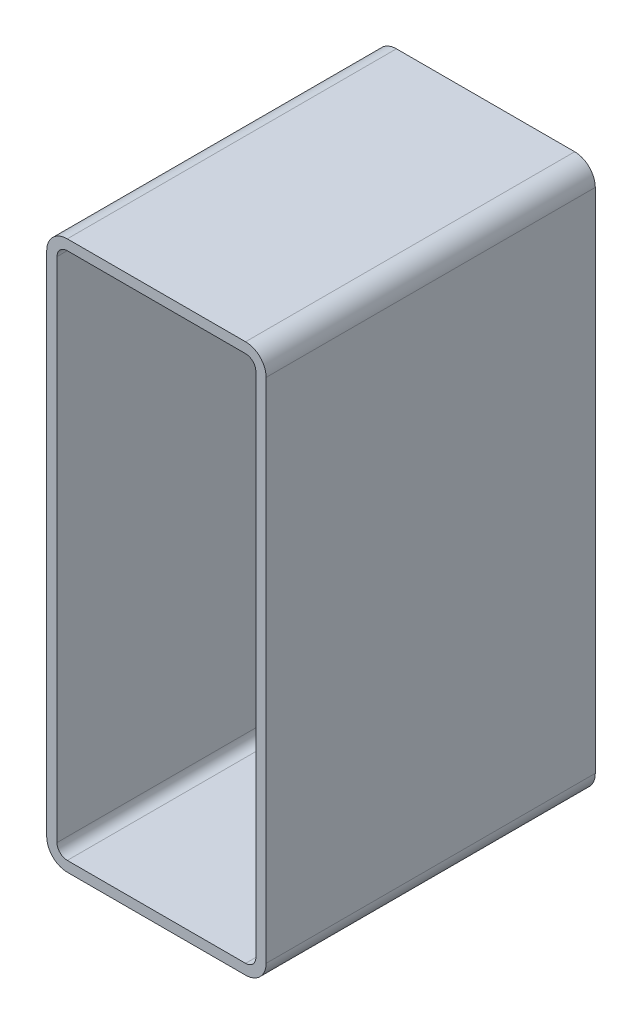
ISO-10303-21;
HEADER;
FILE_DESCRIPTION(('STEP AP214'),'2;1');
FILE_NAME('part.step','',(''),(''),'','','');
FILE_SCHEMA(('AUTOMOTIVE_DESIGN { 1 0 10303 214 1 1 1 1 }'));
ENDSEC;
DATA;
#1=APPLICATION_CONTEXT('core data for automotive mechanical design processes');
#2=APPLICATION_PROTOCOL_DEFINITION('international standard','automotive_design',2000,#1);
#3=PRODUCT_CONTEXT('',#1,'mechanical');
#4=PRODUCT('Part','Part','',(#3));
#5=PRODUCT_RELATED_PRODUCT_CATEGORY('part','',(#4));
#6=PRODUCT_DEFINITION_FORMATION('','',#4);
#7=PRODUCT_DEFINITION_CONTEXT('part definition',#1,'design');
#8=PRODUCT_DEFINITION('design','',#6,#7);
#9=PRODUCT_DEFINITION_SHAPE('','',#8);
#10=(LENGTH_UNIT() NAMED_UNIT(*) SI_UNIT(.MILLI.,.METRE.));
#11=(NAMED_UNIT(*) PLANE_ANGLE_UNIT() SI_UNIT($,.RADIAN.));
#12=(NAMED_UNIT(*) SI_UNIT($,.STERADIAN.) SOLID_ANGLE_UNIT());
#13=UNCERTAINTY_MEASURE_WITH_UNIT(LENGTH_MEASURE(1.E-05),#10,'distance_accuracy_value','');
#14=(GEOMETRIC_REPRESENTATION_CONTEXT(3) GLOBAL_UNCERTAINTY_ASSIGNED_CONTEXT((#13)) GLOBAL_UNIT_ASSIGNED_CONTEXT((#10,
#11,#12)) REPRESENTATION_CONTEXT('',''));
#15=CARTESIAN_POINT('',(0.,0.,0.));
#16=DIRECTION('',(0.,0.,1.));
#17=DIRECTION('',(1.,0.,0.));
#18=AXIS2_PLACEMENT_3D('',#15,#16,#17);
#19=CARTESIAN_POINT('',(20.4409404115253,20.741228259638,304.8));
#20=DIRECTION('',(0.,0.,1.));
#21=DIRECTION('',(1.,0.,0.));
#22=AXIS2_PLACEMENT_3D('',#19,#20,#21);
#23=PLANE('',#22);
#24=CARTESIAN_POINT('',(20.4409404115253,20.741228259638,304.8));
#25=DIRECTION('',(0.,0.,1.));
#26=DIRECTION('',(1.,0.,0.));
#27=AXIS2_PLACEMENT_3D('',#24,#25,#26);
#28=CIRCLE('',#27,19.05);
#29=CARTESIAN_POINT('',(1.3909404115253,20.741228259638,304.8));
#30=VERTEX_POINT('',#29);
#31=CARTESIAN_POINT('',(20.4409404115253,1.69122825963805,304.8));
#32=VERTEX_POINT('',#31);
#33=EDGE_CURVE('E211',#30,#32,#28,.T.);
#34=ORIENTED_EDGE('',*,*,#33,.T.);
#35=DIRECTION('',(1.,0.,0.));
#36=VECTOR('',#35,1.);
#37=CARTESIAN_POINT('',(185.540940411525,1.691228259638,304.8));
#38=LINE('',#37,#36);
#39=CARTESIAN_POINT('',(185.540940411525,1.69122825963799,304.8));
#40=VERTEX_POINT('',#39);
#41=EDGE_CURVE('E214',#32,#40,#38,.T.);
#42=ORIENTED_EDGE('',*,*,#41,.T.);
#43=CARTESIAN_POINT('',(185.540940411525,20.741228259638,304.8));
#44=DIRECTION('',(0.,0.,1.));
#45=DIRECTION('',(1.,0.,0.));
#46=AXIS2_PLACEMENT_3D('',#43,#44,#45);
#47=CIRCLE('',#46,19.05);
#48=CARTESIAN_POINT('',(204.590940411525,20.741228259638,304.8));
#49=VERTEX_POINT('',#48);
#50=EDGE_CURVE('E217',#40,#49,#47,.T.);
#51=ORIENTED_EDGE('',*,*,#50,.T.);
#52=DIRECTION('',(0.,1.,0.));
#53=VECTOR('',#52,1.);
#54=CARTESIAN_POINT('',(204.590940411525,490.641228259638,304.8));
#55=LINE('',#54,#53);
#56=CARTESIAN_POINT('',(204.590940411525,490.641228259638,304.8));
#57=VERTEX_POINT('',#56);
#58=EDGE_CURVE('E219',#49,#57,#55,.T.);
#59=ORIENTED_EDGE('',*,*,#58,.T.);
#60=CARTESIAN_POINT('',(185.540940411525,490.641228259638,304.8));
#61=DIRECTION('',(0.,0.,1.));
#62=DIRECTION('',(1.,0.,0.));
#63=AXIS2_PLACEMENT_3D('',#60,#61,#62);
#64=CIRCLE('',#63,19.0499999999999);
#65=CARTESIAN_POINT('',(185.540940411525,509.691228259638,304.8));
#66=VERTEX_POINT('',#65);
#67=EDGE_CURVE('E221',#57,#66,#64,.T.);
#68=ORIENTED_EDGE('',*,*,#67,.T.);
#69=DIRECTION('',(-1.,0.,0.));
#70=VECTOR('',#69,1.);
#71=CARTESIAN_POINT('',(20.4409404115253,509.691228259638,304.8));
#72=LINE('',#71,#70);
#73=CARTESIAN_POINT('',(20.4409404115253,509.691228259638,304.8));
#74=VERTEX_POINT('',#73);
#75=EDGE_CURVE('E223',#66,#74,#72,.T.);
#76=ORIENTED_EDGE('',*,*,#75,.T.);
#77=CARTESIAN_POINT('',(20.4409404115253,490.641228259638,304.8));
#78=DIRECTION('',(0.,0.,1.));
#79=DIRECTION('',(1.,0.,0.));
#80=AXIS2_PLACEMENT_3D('',#77,#78,#79);
#81=CIRCLE('',#80,19.0499999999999);
#82=CARTESIAN_POINT('',(1.3909404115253,490.641228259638,304.8));
#83=VERTEX_POINT('',#82);
#84=EDGE_CURVE('E225',#74,#83,#81,.T.);
#85=ORIENTED_EDGE('',*,*,#84,.T.);
#86=DIRECTION('',(0.,-1.,0.));
#87=VECTOR('',#86,1.);
#88=CARTESIAN_POINT('',(1.3909404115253,20.741228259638,304.8));
#89=LINE('',#88,#87);
#90=EDGE_CURVE('E227',#83,#30,#89,.T.);
#91=ORIENTED_EDGE('',*,*,#90,.T.);
#92=EDGE_LOOP('',(#34,#42,#51,#59,#68,#76,#85,#91));
#93=FACE_BOUND('',#92,.T.);
#94=DIRECTION('',(0.,-1.,0.));
#95=VECTOR('',#94,1.);
#96=CARTESIAN_POINT('',(10.9159404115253,20.741228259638,304.8));
#97=LINE('',#96,#95);
#98=CARTESIAN_POINT('',(10.9159404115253,490.641228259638,304.8));
#99=VERTEX_POINT('',#98);
#100=CARTESIAN_POINT('',(10.9159404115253,20.741228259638,304.8));
#101=VERTEX_POINT('',#100);
#102=EDGE_CURVE('E154',#99,#101,#97,.T.);
#103=ORIENTED_EDGE('',*,*,#102,.F.);
#104=CARTESIAN_POINT('',(20.4409404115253,490.641228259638,304.8));
#105=DIRECTION('',(0.,0.,1.));
#106=DIRECTION('',(1.,0.,0.));
#107=AXIS2_PLACEMENT_3D('',#104,#105,#106);
#108=CIRCLE('',#107,9.52499999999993);
#109=CARTESIAN_POINT('',(20.4409404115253,500.166228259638,304.8));
#110=VERTEX_POINT('',#109);
#111=EDGE_CURVE('E146',#110,#99,#108,.T.);
#112=ORIENTED_EDGE('',*,*,#111,.F.);
#113=DIRECTION('',(-1.,0.,0.));
#114=VECTOR('',#113,1.);
#115=CARTESIAN_POINT('',(20.4409404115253,500.166228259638,304.8));
#116=LINE('',#115,#114);
#117=CARTESIAN_POINT('',(185.540940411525,500.166228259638,304.8));
#118=VERTEX_POINT('',#117);
#119=EDGE_CURVE('E179',#118,#110,#116,.T.);
#120=ORIENTED_EDGE('',*,*,#119,.F.);
#121=CARTESIAN_POINT('',(185.540940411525,490.641228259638,304.8));
#122=DIRECTION('',(0.,0.,1.));
#123=DIRECTION('',(1.,0.,0.));
#124=AXIS2_PLACEMENT_3D('',#121,#122,#123);
#125=CIRCLE('',#124,9.52499999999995);
#126=CARTESIAN_POINT('',(195.065940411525,490.641228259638,304.8));
#127=VERTEX_POINT('',#126);
#128=EDGE_CURVE('E177',#127,#118,#125,.T.);
#129=ORIENTED_EDGE('',*,*,#128,.F.);
#130=DIRECTION('',(0.,1.,0.));
#131=VECTOR('',#130,1.);
#132=CARTESIAN_POINT('',(195.065940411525,490.641228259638,304.8));
#133=LINE('',#132,#131);
#134=CARTESIAN_POINT('',(195.065940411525,20.741228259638,304.8));
#135=VERTEX_POINT('',#134);
#136=EDGE_CURVE('E175',#135,#127,#133,.T.);
#137=ORIENTED_EDGE('',*,*,#136,.F.);
#138=CARTESIAN_POINT('',(185.540940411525,20.741228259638,304.8));
#139=DIRECTION('',(0.,0.,1.));
#140=DIRECTION('',(1.,0.,0.));
#141=AXIS2_PLACEMENT_3D('',#138,#139,#140);
#142=CIRCLE('',#141,9.52499999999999);
#143=CARTESIAN_POINT('',(185.540940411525,11.216228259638,304.8));
#144=VERTEX_POINT('',#143);
#145=EDGE_CURVE('E173',#144,#135,#142,.T.);
#146=ORIENTED_EDGE('',*,*,#145,.F.);
#147=DIRECTION('',(1.,0.,0.));
#148=VECTOR('',#147,1.);
#149=CARTESIAN_POINT('',(185.540940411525,11.216228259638,304.8));
#150=LINE('',#149,#148);
#151=CARTESIAN_POINT('',(20.4409404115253,11.216228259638,304.8));
#152=VERTEX_POINT('',#151);
#153=EDGE_CURVE('E169',#152,#144,#150,.T.);
#154=ORIENTED_EDGE('',*,*,#153,.F.);
#155=CARTESIAN_POINT('',(20.4409404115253,20.741228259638,304.8));
#156=DIRECTION('',(0.,0.,1.));
#157=DIRECTION('',(1.,0.,0.));
#158=AXIS2_PLACEMENT_3D('',#155,#156,#157);
#159=CIRCLE('',#158,9.52499999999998);
#160=EDGE_CURVE('E167',#101,#152,#159,.T.);
#161=ORIENTED_EDGE('',*,*,#160,.F.);
#162=EDGE_LOOP('',(#103,#112,#120,#129,#137,#146,#154,#161));
#163=FACE_BOUND('',#162,.T.);
#164=ADVANCED_FACE('F33',(#93,#163),#23,.T.);
#165=CARTESIAN_POINT('',(20.4409404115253,20.741228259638,0.));
#166=DIRECTION('',(0.,0.,1.));
#167=DIRECTION('',(1.,0.,0.));
#168=AXIS2_PLACEMENT_3D('',#165,#166,#167);
#169=PLANE('',#168);
#170=CARTESIAN_POINT('',(20.4409404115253,20.741228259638,0.));
#171=DIRECTION('',(0.,0.,1.));
#172=DIRECTION('',(1.,0.,0.));
#173=AXIS2_PLACEMENT_3D('',#170,#171,#172);
#174=CIRCLE('',#173,19.05);
#175=CARTESIAN_POINT('',(1.3909404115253,20.741228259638,0.));
#176=VERTEX_POINT('',#175);
#177=CARTESIAN_POINT('',(20.4409404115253,1.69122825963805,0.));
#178=VERTEX_POINT('',#177);
#179=EDGE_CURVE('E162',#176,#178,#174,.T.);
#180=ORIENTED_EDGE('',*,*,#179,.F.);
#181=DIRECTION('',(0.,-1.,0.));
#182=VECTOR('',#181,1.);
#183=CARTESIAN_POINT('',(1.3909404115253,20.741228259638,0.));
#184=LINE('',#183,#182);
#185=CARTESIAN_POINT('',(1.3909404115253,490.641228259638,0.));
#186=VERTEX_POINT('',#185);
#187=EDGE_CURVE('E215',#186,#176,#184,.T.);
#188=ORIENTED_EDGE('',*,*,#187,.F.);
#189=CARTESIAN_POINT('',(20.4409404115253,490.641228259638,0.));
#190=DIRECTION('',(0.,0.,1.));
#191=DIRECTION('',(1.,0.,0.));
#192=AXIS2_PLACEMENT_3D('',#189,#190,#191);
#193=CIRCLE('',#192,19.0499999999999);
#194=CARTESIAN_POINT('',(20.4409404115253,509.691228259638,0.));
#195=VERTEX_POINT('',#194);
#196=EDGE_CURVE('E242',#195,#186,#193,.T.);
#197=ORIENTED_EDGE('',*,*,#196,.F.);
#198=DIRECTION('',(-1.,0.,0.));
#199=VECTOR('',#198,1.);
#200=CARTESIAN_POINT('',(20.4409404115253,509.691228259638,0.));
#201=LINE('',#200,#199);
#202=CARTESIAN_POINT('',(185.540940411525,509.691228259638,0.));
#203=VERTEX_POINT('',#202);
#204=EDGE_CURVE('E240',#203,#195,#201,.T.);
#205=ORIENTED_EDGE('',*,*,#204,.F.);
#206=CARTESIAN_POINT('',(185.540940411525,490.641228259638,0.));
#207=DIRECTION('',(0.,0.,1.));
#208=DIRECTION('',(1.,0.,0.));
#209=AXIS2_PLACEMENT_3D('',#206,#207,#208);
#210=CIRCLE('',#209,19.0499999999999);
#211=CARTESIAN_POINT('',(204.590940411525,490.641228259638,0.));
#212=VERTEX_POINT('',#211);
#213=EDGE_CURVE('E238',#212,#203,#210,.T.);
#214=ORIENTED_EDGE('',*,*,#213,.F.);
#215=DIRECTION('',(0.,1.,0.));
#216=VECTOR('',#215,1.);
#217=CARTESIAN_POINT('',(204.590940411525,490.641228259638,0.));
#218=LINE('',#217,#216);
#219=CARTESIAN_POINT('',(204.590940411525,20.741228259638,0.));
#220=VERTEX_POINT('',#219);
#221=EDGE_CURVE('E236',#220,#212,#218,.T.);
#222=ORIENTED_EDGE('',*,*,#221,.F.);
#223=CARTESIAN_POINT('',(185.540940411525,20.741228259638,0.));
#224=DIRECTION('',(0.,0.,1.));
#225=DIRECTION('',(1.,0.,0.));
#226=AXIS2_PLACEMENT_3D('',#223,#224,#225);
#227=CIRCLE('',#226,19.05);
#228=CARTESIAN_POINT('',(185.540940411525,1.69122825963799,0.));
#229=VERTEX_POINT('',#228);
#230=EDGE_CURVE('E234',#229,#220,#227,.T.);
#231=ORIENTED_EDGE('',*,*,#230,.F.);
#232=DIRECTION('',(1.,0.,0.));
#233=VECTOR('',#232,1.);
#234=CARTESIAN_POINT('',(185.540940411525,1.691228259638,0.));
#235=LINE('',#234,#233);
#236=EDGE_CURVE('E232',#178,#229,#235,.T.);
#237=ORIENTED_EDGE('',*,*,#236,.F.);
#238=EDGE_LOOP('',(#180,#188,#197,#205,#214,#222,#231,#237));
#239=FACE_BOUND('',#238,.T.);
#240=CARTESIAN_POINT('',(20.4409404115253,490.641228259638,0.));
#241=DIRECTION('',(0.,0.,1.));
#242=DIRECTION('',(1.,0.,0.));
#243=AXIS2_PLACEMENT_3D('',#240,#241,#242);
#244=CIRCLE('',#243,9.52499999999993);
#245=CARTESIAN_POINT('',(20.4409404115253,500.166228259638,0.));
#246=VERTEX_POINT('',#245);
#247=CARTESIAN_POINT('',(10.9159404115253,490.641228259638,0.));
#248=VERTEX_POINT('',#247);
#249=EDGE_CURVE('E56',#246,#248,#244,.T.);
#250=ORIENTED_EDGE('',*,*,#249,.T.);
#251=DIRECTION('',(0.,-1.,0.));
#252=VECTOR('',#251,1.);
#253=CARTESIAN_POINT('',(10.9159404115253,20.741228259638,0.));
#254=LINE('',#253,#252);
#255=CARTESIAN_POINT('',(10.9159404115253,20.741228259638,0.));
#256=VERTEX_POINT('',#255);
#257=EDGE_CURVE('E161',#248,#256,#254,.T.);
#258=ORIENTED_EDGE('',*,*,#257,.T.);
#259=CARTESIAN_POINT('',(20.4409404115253,20.741228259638,0.));
#260=DIRECTION('',(0.,0.,1.));
#261=DIRECTION('',(1.,0.,0.));
#262=AXIS2_PLACEMENT_3D('',#259,#260,#261);
#263=CIRCLE('',#262,9.52499999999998);
#264=CARTESIAN_POINT('',(20.4409404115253,11.216228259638,0.));
#265=VERTEX_POINT('',#264);
#266=EDGE_CURVE('E183',#256,#265,#263,.T.);
#267=ORIENTED_EDGE('',*,*,#266,.T.);
#268=DIRECTION('',(1.,0.,0.));
#269=VECTOR('',#268,1.);
#270=CARTESIAN_POINT('',(185.540940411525,11.216228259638,0.));
#271=LINE('',#270,#269);
#272=CARTESIAN_POINT('',(185.540940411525,11.216228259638,0.));
#273=VERTEX_POINT('',#272);
#274=EDGE_CURVE('E186',#265,#273,#271,.T.);
#275=ORIENTED_EDGE('',*,*,#274,.T.);
#276=CARTESIAN_POINT('',(185.540940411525,20.741228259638,0.));
#277=DIRECTION('',(0.,0.,1.));
#278=DIRECTION('',(1.,0.,0.));
#279=AXIS2_PLACEMENT_3D('',#276,#277,#278);
#280=CIRCLE('',#279,9.52499999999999);
#281=CARTESIAN_POINT('',(195.065940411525,20.741228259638,0.));
#282=VERTEX_POINT('',#281);
#283=EDGE_CURVE('E189',#273,#282,#280,.T.);
#284=ORIENTED_EDGE('',*,*,#283,.T.);
#285=DIRECTION('',(0.,1.,0.));
#286=VECTOR('',#285,1.);
#287=CARTESIAN_POINT('',(195.065940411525,490.641228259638,0.));
#288=LINE('',#287,#286);
#289=CARTESIAN_POINT('',(195.065940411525,490.641228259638,0.));
#290=VERTEX_POINT('',#289);
#291=EDGE_CURVE('E192',#282,#290,#288,.T.);
#292=ORIENTED_EDGE('',*,*,#291,.T.);
#293=CARTESIAN_POINT('',(185.540940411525,490.641228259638,0.));
#294=DIRECTION('',(0.,0.,1.));
#295=DIRECTION('',(1.,0.,0.));
#296=AXIS2_PLACEMENT_3D('',#293,#294,#295);
#297=CIRCLE('',#296,9.52499999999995);
#298=CARTESIAN_POINT('',(185.540940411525,500.166228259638,0.));
#299=VERTEX_POINT('',#298);
#300=EDGE_CURVE('E195',#290,#299,#297,.T.);
#301=ORIENTED_EDGE('',*,*,#300,.T.);
#302=DIRECTION('',(-1.,0.,0.));
#303=VECTOR('',#302,1.);
#304=CARTESIAN_POINT('',(20.4409404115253,500.166228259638,0.));
#305=LINE('',#304,#303);
#306=EDGE_CURVE('E155',#299,#246,#305,.T.);
#307=ORIENTED_EDGE('',*,*,#306,.T.);
#308=EDGE_LOOP('',(#250,#258,#267,#275,#284,#292,#301,#307));
#309=FACE_BOUND('',#308,.T.);
#310=ADVANCED_FACE('F272',(#239,#309),#169,.F.);
#311=CARTESIAN_POINT('',(20.4409404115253,20.741228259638,304.8));
#312=DIRECTION('',(0.,0.,-1.));
#313=DIRECTION('',(-1.,0.,0.));
#314=AXIS2_PLACEMENT_3D('',#311,#312,#313);
#315=CYLINDRICAL_SURFACE('',#314,19.05);
#316=ORIENTED_EDGE('',*,*,#179,.T.);
#317=DIRECTION('',(0.,0.,-1.));
#318=VECTOR('',#317,1.);
#319=CARTESIAN_POINT('',(20.4409404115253,1.69122825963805,304.8));
#320=LINE('',#319,#318);
#321=EDGE_CURVE('E11',#32,#178,#320,.T.);
#322=ORIENTED_EDGE('',*,*,#321,.F.);
#323=ORIENTED_EDGE('',*,*,#33,.F.);
#324=DIRECTION('',(0.,0.,-1.));
#325=VECTOR('',#324,1.);
#326=CARTESIAN_POINT('',(1.3909404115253,20.741228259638,304.8));
#327=LINE('',#326,#325);
#328=EDGE_CURVE('E229',#30,#176,#327,.T.);
#329=ORIENTED_EDGE('',*,*,#328,.T.);
#330=EDGE_LOOP('',(#316,#322,#323,#329));
#331=FACE_BOUND('',#330,.T.);
#332=ADVANCED_FACE('F35',(#331),#315,.T.);
#333=CARTESIAN_POINT('',(185.540940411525,1.691228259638,304.8));
#334=DIRECTION('',(0.,1.,0.));
#335=DIRECTION('',(-1.,0.,0.));
#336=AXIS2_PLACEMENT_3D('',#333,#334,#335);
#337=PLANE('',#336);
#338=ORIENTED_EDGE('',*,*,#236,.T.);
#339=DIRECTION('',(0.,0.,-1.));
#340=VECTOR('',#339,1.);
#341=CARTESIAN_POINT('',(185.540940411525,1.69122825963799,304.8));
#342=LINE('',#341,#340);
#343=EDGE_CURVE('E41',#40,#229,#342,.T.);
#344=ORIENTED_EDGE('',*,*,#343,.F.);
#345=ORIENTED_EDGE('',*,*,#41,.F.);
#346=ORIENTED_EDGE('',*,*,#321,.T.);
#347=EDGE_LOOP('',(#338,#344,#345,#346));
#348=FACE_BOUND('',#347,.T.);
#349=ADVANCED_FACE('F289',(#348),#337,.F.);
#350=CARTESIAN_POINT('',(185.540940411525,20.741228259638,304.8));
#351=DIRECTION('',(0.,0.,-1.));
#352=DIRECTION('',(-1.,0.,0.));
#353=AXIS2_PLACEMENT_3D('',#350,#351,#352);
#354=CYLINDRICAL_SURFACE('',#353,19.05);
#355=ORIENTED_EDGE('',*,*,#230,.T.);
#356=DIRECTION('',(0.,0.,-1.));
#357=VECTOR('',#356,1.);
#358=CARTESIAN_POINT('',(204.590940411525,20.741228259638,304.8));
#359=LINE('',#358,#357);
#360=EDGE_CURVE('E259',#49,#220,#359,.T.);
#361=ORIENTED_EDGE('',*,*,#360,.F.);
#362=ORIENTED_EDGE('',*,*,#50,.F.);
#363=ORIENTED_EDGE('',*,*,#343,.T.);
#364=EDGE_LOOP('',(#355,#361,#362,#363));
#365=FACE_BOUND('',#364,.T.);
#366=ADVANCED_FACE('F266',(#365),#354,.T.);
#367=CARTESIAN_POINT('',(204.590940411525,490.641228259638,304.8));
#368=DIRECTION('',(-1.,0.,0.));
#369=DIRECTION('',(0.,0.,1.));
#370=AXIS2_PLACEMENT_3D('',#367,#368,#369);
#371=PLANE('',#370);
#372=ORIENTED_EDGE('',*,*,#221,.T.);
#373=DIRECTION('',(0.,0.,-1.));
#374=VECTOR('',#373,1.);
#375=CARTESIAN_POINT('',(204.590940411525,490.641228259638,304.8));
#376=LINE('',#375,#374);
#377=EDGE_CURVE('E256',#57,#212,#376,.T.);
#378=ORIENTED_EDGE('',*,*,#377,.F.);
#379=ORIENTED_EDGE('',*,*,#58,.F.);
#380=ORIENTED_EDGE('',*,*,#360,.T.);
#381=EDGE_LOOP('',(#372,#378,#379,#380));
#382=FACE_BOUND('',#381,.T.);
#383=ADVANCED_FACE('F278',(#382),#371,.F.);
#384=CARTESIAN_POINT('',(185.540940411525,490.641228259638,304.8));
#385=DIRECTION('',(0.,0.,-1.));
#386=DIRECTION('',(-1.,0.,0.));
#387=AXIS2_PLACEMENT_3D('',#384,#385,#386);
#388=CYLINDRICAL_SURFACE('',#387,19.0499999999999);
#389=ORIENTED_EDGE('',*,*,#213,.T.);
#390=DIRECTION('',(0.,0.,-1.));
#391=VECTOR('',#390,1.);
#392=CARTESIAN_POINT('',(185.540940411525,509.691228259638,304.8));
#393=LINE('',#392,#391);
#394=EDGE_CURVE('E253',#66,#203,#393,.T.);
#395=ORIENTED_EDGE('',*,*,#394,.F.);
#396=ORIENTED_EDGE('',*,*,#67,.F.);
#397=ORIENTED_EDGE('',*,*,#377,.T.);
#398=EDGE_LOOP('',(#389,#395,#396,#397));
#399=FACE_BOUND('',#398,.T.);
#400=ADVANCED_FACE('F282',(#399),#388,.T.);
#401=CARTESIAN_POINT('',(20.4409404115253,509.691228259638,304.8));
#402=DIRECTION('',(0.,-1.,0.));
#403=DIRECTION('',(0.,0.,-1.));
#404=AXIS2_PLACEMENT_3D('',#401,#402,#403);
#405=PLANE('',#404);
#406=ORIENTED_EDGE('',*,*,#204,.T.);
#407=DIRECTION('',(0.,0.,-1.));
#408=VECTOR('',#407,1.);
#409=CARTESIAN_POINT('',(20.4409404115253,509.691228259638,304.8));
#410=LINE('',#409,#408);
#411=EDGE_CURVE('E250',#74,#195,#410,.T.);
#412=ORIENTED_EDGE('',*,*,#411,.F.);
#413=ORIENTED_EDGE('',*,*,#75,.F.);
#414=ORIENTED_EDGE('',*,*,#394,.T.);
#415=EDGE_LOOP('',(#406,#412,#413,#414));
#416=FACE_BOUND('',#415,.T.);
#417=ADVANCED_FACE('F302',(#416),#405,.F.);
#418=CARTESIAN_POINT('',(20.4409404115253,490.641228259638,304.8));
#419=DIRECTION('',(0.,0.,-1.));
#420=DIRECTION('',(-1.,0.,0.));
#421=AXIS2_PLACEMENT_3D('',#418,#419,#420);
#422=CYLINDRICAL_SURFACE('',#421,19.0499999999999);
#423=ORIENTED_EDGE('',*,*,#196,.T.);
#424=DIRECTION('',(0.,0.,-1.));
#425=VECTOR('',#424,1.);
#426=CARTESIAN_POINT('',(1.3909404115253,490.641228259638,304.8));
#427=LINE('',#426,#425);
#428=EDGE_CURVE('E247',#83,#186,#427,.T.);
#429=ORIENTED_EDGE('',*,*,#428,.F.);
#430=ORIENTED_EDGE('',*,*,#84,.F.);
#431=ORIENTED_EDGE('',*,*,#411,.T.);
#432=EDGE_LOOP('',(#423,#429,#430,#431));
#433=FACE_BOUND('',#432,.T.);
#434=ADVANCED_FACE('F300',(#433),#422,.T.);
#435=CARTESIAN_POINT('',(1.3909404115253,20.741228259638,304.8));
#436=DIRECTION('',(1.,0.,0.));
#437=DIRECTION('',(0.,0.,-1.));
#438=AXIS2_PLACEMENT_3D('',#435,#436,#437);
#439=PLANE('',#438);
#440=ORIENTED_EDGE('',*,*,#187,.T.);
#441=ORIENTED_EDGE('',*,*,#328,.F.);
#442=ORIENTED_EDGE('',*,*,#90,.F.);
#443=ORIENTED_EDGE('',*,*,#428,.T.);
#444=EDGE_LOOP('',(#440,#441,#442,#443));
#445=FACE_BOUND('',#444,.T.);
#446=ADVANCED_FACE('F295',(#445),#439,.F.);
#447=CARTESIAN_POINT('',(20.4409404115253,490.641228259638,304.8));
#448=DIRECTION('',(0.,0.,-1.));
#449=DIRECTION('',(-1.,0.,0.));
#450=AXIS2_PLACEMENT_3D('',#447,#448,#449);
#451=CYLINDRICAL_SURFACE('',#450,9.52499999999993);
#452=ORIENTED_EDGE('',*,*,#249,.F.);
#453=DIRECTION('',(0.,0.,-1.));
#454=VECTOR('',#453,1.);
#455=CARTESIAN_POINT('',(20.4409404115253,500.166228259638,304.8));
#456=LINE('',#455,#454);
#457=EDGE_CURVE('E150',#110,#246,#456,.T.);
#458=ORIENTED_EDGE('',*,*,#457,.F.);
#459=ORIENTED_EDGE('',*,*,#111,.T.);
#460=DIRECTION('',(0.,0.,-1.));
#461=VECTOR('',#460,1.);
#462=CARTESIAN_POINT('',(10.9159404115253,490.641228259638,304.8));
#463=LINE('',#462,#461);
#464=EDGE_CURVE('E149',#99,#248,#463,.T.);
#465=ORIENTED_EDGE('',*,*,#464,.T.);
#466=EDGE_LOOP('',(#452,#458,#459,#465));
#467=FACE_BOUND('',#466,.T.);
#468=ADVANCED_FACE('F148',(#467),#451,.F.);
#469=CARTESIAN_POINT('',(10.9159404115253,20.741228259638,304.8));
#470=DIRECTION('',(1.,0.,0.));
#471=DIRECTION('',(0.,0.,-1.));
#472=AXIS2_PLACEMENT_3D('',#469,#470,#471);
#473=PLANE('',#472);
#474=ORIENTED_EDGE('',*,*,#257,.F.);
#475=ORIENTED_EDGE('',*,*,#464,.F.);
#476=ORIENTED_EDGE('',*,*,#102,.T.);
#477=DIRECTION('',(0.,0.,-1.));
#478=VECTOR('',#477,1.);
#479=CARTESIAN_POINT('',(10.9159404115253,20.741228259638,304.8));
#480=LINE('',#479,#478);
#481=EDGE_CURVE('E163',#101,#256,#480,.T.);
#482=ORIENTED_EDGE('',*,*,#481,.T.);
#483=EDGE_LOOP('',(#474,#475,#476,#482));
#484=FACE_BOUND('',#483,.T.);
#485=ADVANCED_FACE('F158',(#484),#473,.T.);
#486=CARTESIAN_POINT('',(20.4409404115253,20.741228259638,304.8));
#487=DIRECTION('',(0.,0.,-1.));
#488=DIRECTION('',(-1.,0.,0.));
#489=AXIS2_PLACEMENT_3D('',#486,#487,#488);
#490=CYLINDRICAL_SURFACE('',#489,9.52499999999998);
#491=ORIENTED_EDGE('',*,*,#266,.F.);
#492=ORIENTED_EDGE('',*,*,#481,.F.);
#493=ORIENTED_EDGE('',*,*,#160,.T.);
#494=DIRECTION('',(0.,0.,-1.));
#495=VECTOR('',#494,1.);
#496=CARTESIAN_POINT('',(20.4409404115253,11.216228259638,304.8));
#497=LINE('',#496,#495);
#498=EDGE_CURVE('E208',#152,#265,#497,.T.);
#499=ORIENTED_EDGE('',*,*,#498,.T.);
#500=EDGE_LOOP('',(#491,#492,#493,#499));
#501=FACE_BOUND('',#500,.T.);
#502=ADVANCED_FACE('F327',(#501),#490,.F.);
#503=CARTESIAN_POINT('',(185.540940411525,11.216228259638,304.8));
#504=DIRECTION('',(0.,1.,0.));
#505=DIRECTION('',(0.,0.,1.));
#506=AXIS2_PLACEMENT_3D('',#503,#504,#505);
#507=PLANE('',#506);
#508=ORIENTED_EDGE('',*,*,#274,.F.);
#509=ORIENTED_EDGE('',*,*,#498,.F.);
#510=ORIENTED_EDGE('',*,*,#153,.T.);
#511=DIRECTION('',(0.,0.,-1.));
#512=VECTOR('',#511,1.);
#513=CARTESIAN_POINT('',(185.540940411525,11.216228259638,304.8));
#514=LINE('',#513,#512);
#515=EDGE_CURVE('E206',#144,#273,#514,.T.);
#516=ORIENTED_EDGE('',*,*,#515,.T.);
#517=EDGE_LOOP('',(#508,#509,#510,#516));
#518=FACE_BOUND('',#517,.T.);
#519=ADVANCED_FACE('F331',(#518),#507,.T.);
#520=CARTESIAN_POINT('',(185.540940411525,20.741228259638,304.8));
#521=DIRECTION('',(0.,0.,-1.));
#522=DIRECTION('',(-1.,0.,0.));
#523=AXIS2_PLACEMENT_3D('',#520,#521,#522);
#524=CYLINDRICAL_SURFACE('',#523,9.52499999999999);
#525=ORIENTED_EDGE('',*,*,#283,.F.);
#526=ORIENTED_EDGE('',*,*,#515,.F.);
#527=ORIENTED_EDGE('',*,*,#145,.T.);
#528=DIRECTION('',(0.,0.,-1.));
#529=VECTOR('',#528,1.);
#530=CARTESIAN_POINT('',(195.065940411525,20.741228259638,304.8));
#531=LINE('',#530,#529);
#532=EDGE_CURVE('E204',#135,#282,#531,.T.);
#533=ORIENTED_EDGE('',*,*,#532,.T.);
#534=EDGE_LOOP('',(#525,#526,#527,#533));
#535=FACE_BOUND('',#534,.T.);
#536=ADVANCED_FACE('F337',(#535),#524,.F.);
#537=CARTESIAN_POINT('',(195.065940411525,490.641228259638,304.8));
#538=DIRECTION('',(-1.,0.,0.));
#539=DIRECTION('',(0.,0.,1.));
#540=AXIS2_PLACEMENT_3D('',#537,#538,#539);
#541=PLANE('',#540);
#542=ORIENTED_EDGE('',*,*,#291,.F.);
#543=ORIENTED_EDGE('',*,*,#532,.F.);
#544=ORIENTED_EDGE('',*,*,#136,.T.);
#545=DIRECTION('',(0.,0.,-1.));
#546=VECTOR('',#545,1.);
#547=CARTESIAN_POINT('',(195.065940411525,490.641228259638,304.8));
#548=LINE('',#547,#546);
#549=EDGE_CURVE('E202',#127,#290,#548,.T.);
#550=ORIENTED_EDGE('',*,*,#549,.T.);
#551=EDGE_LOOP('',(#542,#543,#544,#550));
#552=FACE_BOUND('',#551,.T.);
#553=ADVANCED_FACE('F341',(#552),#541,.T.);
#554=CARTESIAN_POINT('',(185.540940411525,490.641228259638,304.8));
#555=DIRECTION('',(0.,0.,-1.));
#556=DIRECTION('',(-1.,0.,0.));
#557=AXIS2_PLACEMENT_3D('',#554,#555,#556);
#558=CYLINDRICAL_SURFACE('',#557,9.52499999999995);
#559=ORIENTED_EDGE('',*,*,#300,.F.);
#560=ORIENTED_EDGE('',*,*,#549,.F.);
#561=ORIENTED_EDGE('',*,*,#128,.T.);
#562=DIRECTION('',(0.,0.,-1.));
#563=VECTOR('',#562,1.);
#564=CARTESIAN_POINT('',(185.540940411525,500.166228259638,304.8));
#565=LINE('',#564,#563);
#566=EDGE_CURVE('E48',#118,#299,#565,.T.);
#567=ORIENTED_EDGE('',*,*,#566,.T.);
#568=EDGE_LOOP('',(#559,#560,#561,#567));
#569=FACE_BOUND('',#568,.T.);
#570=ADVANCED_FACE('F345',(#569),#558,.F.);
#571=CARTESIAN_POINT('',(20.4409404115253,500.166228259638,304.8));
#572=DIRECTION('',(0.,-1.,0.));
#573=DIRECTION('',(0.,0.,-1.));
#574=AXIS2_PLACEMENT_3D('',#571,#572,#573);
#575=PLANE('',#574);
#576=ORIENTED_EDGE('',*,*,#306,.F.);
#577=ORIENTED_EDGE('',*,*,#566,.F.);
#578=ORIENTED_EDGE('',*,*,#119,.T.);
#579=ORIENTED_EDGE('',*,*,#457,.T.);
#580=EDGE_LOOP('',(#576,#577,#578,#579));
#581=FACE_BOUND('',#580,.T.);
#582=ADVANCED_FACE('F349',(#581),#575,.T.);
#583=CLOSED_SHELL('',(#164,#310,#332,#349,#366,#383,#400,#417,#434,#446,#468,#485,#502,#519,
#536,#553,#570,#582));
#584=MANIFOLD_SOLID_BREP('B2',#583);
#585=ADVANCED_BREP_SHAPE_REPRESENTATION('',(#18,#584),#14);
#586=SHAPE_DEFINITION_REPRESENTATION(#9,#585);
ENDSEC;
END-ISO-10303-21;
